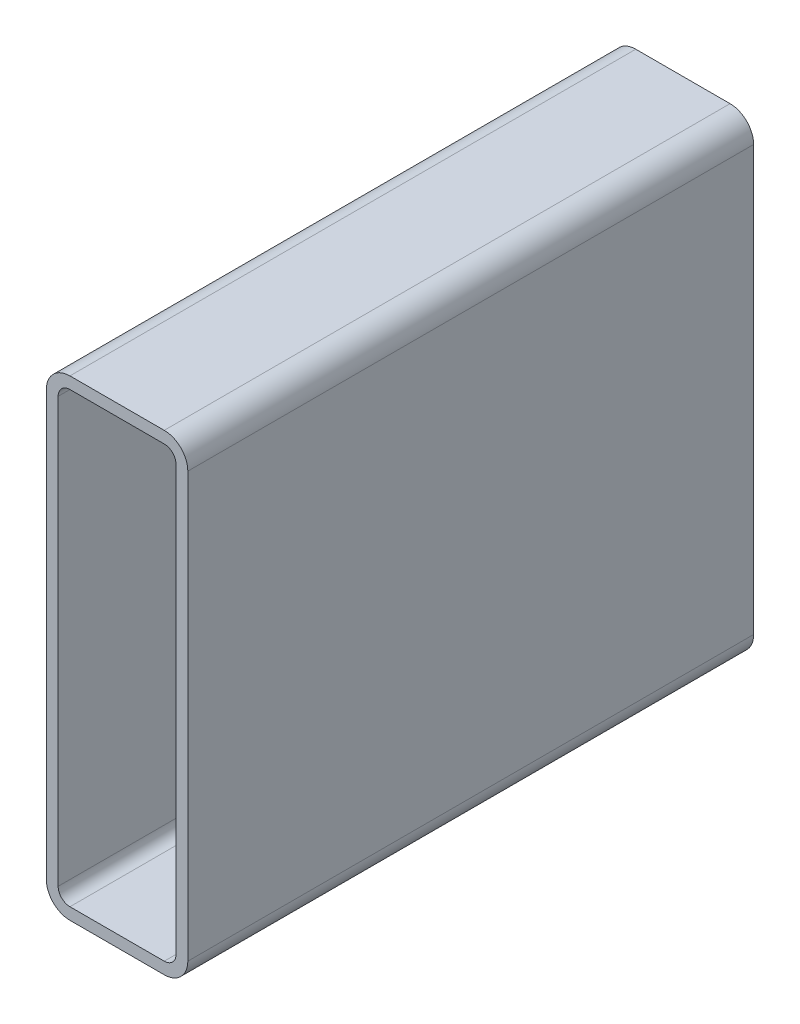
ISO-10303-21;
HEADER;
FILE_DESCRIPTION(('STEP AP214'),'2;1');
FILE_NAME('part.step','',(''),(''),'','','');
FILE_SCHEMA(('AUTOMOTIVE_DESIGN { 1 0 10303 214 1 1 1 1 }'));
ENDSEC;
DATA;
#1=APPLICATION_CONTEXT('core data for automotive mechanical design processes');
#2=APPLICATION_PROTOCOL_DEFINITION('international standard','automotive_design',2000,#1);
#3=PRODUCT_CONTEXT('',#1,'mechanical');
#4=PRODUCT('Part','Part','',(#3));
#5=PRODUCT_RELATED_PRODUCT_CATEGORY('part','',(#4));
#6=PRODUCT_DEFINITION_FORMATION('','',#4);
#7=PRODUCT_DEFINITION_CONTEXT('part definition',#1,'design');
#8=PRODUCT_DEFINITION('design','',#6,#7);
#9=PRODUCT_DEFINITION_SHAPE('','',#8);
#10=(LENGTH_UNIT() NAMED_UNIT(*) SI_UNIT(.MILLI.,.METRE.));
#11=(NAMED_UNIT(*) PLANE_ANGLE_UNIT() SI_UNIT($,.RADIAN.));
#12=(NAMED_UNIT(*) SI_UNIT($,.STERADIAN.) SOLID_ANGLE_UNIT());
#13=UNCERTAINTY_MEASURE_WITH_UNIT(LENGTH_MEASURE(1.E-05),#10,'distance_accuracy_value','');
#14=(GEOMETRIC_REPRESENTATION_CONTEXT(3) GLOBAL_UNCERTAINTY_ASSIGNED_CONTEXT((#13)) GLOBAL_UNIT_ASSIGNED_CONTEXT((#10,
#11,#12)) REPRESENTATION_CONTEXT('',''));
#15=CARTESIAN_POINT('',(0.,0.,0.));
#16=DIRECTION('',(0.,0.,1.));
#17=DIRECTION('',(1.,0.,0.));
#18=AXIS2_PLACEMENT_3D('',#15,#16,#17);
#19=CARTESIAN_POINT('',(15.1891160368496,243.220313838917,304.8));
#20=DIRECTION('',(0.,0.,1.));
#21=DIRECTION('',(1.,0.,0.));
#22=AXIS2_PLACEMENT_3D('',#19,#20,#21);
#23=PLANE('',#22);
#24=CARTESIAN_POINT('',(15.1891160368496,243.220313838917,304.8));
#25=DIRECTION('',(0.,0.,1.));
#26=DIRECTION('',(1.,0.,0.));
#27=AXIS2_PLACEMENT_3D('',#24,#25,#26);
#28=CIRCLE('',#27,12.7);
#29=CARTESIAN_POINT('',(15.1891160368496,255.920313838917,304.8));
#30=VERTEX_POINT('',#29);
#31=CARTESIAN_POINT('',(2.48911603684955,243.220313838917,304.8));
#32=VERTEX_POINT('',#31);
#33=EDGE_CURVE('E211',#30,#32,#28,.T.);
#34=ORIENTED_EDGE('',*,*,#33,.T.);
#35=DIRECTION('',(0.,-1.,0.));
#36=VECTOR('',#35,1.);
#37=CARTESIAN_POINT('',(2.48911603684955,14.6203138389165,304.8));
#38=LINE('',#37,#36);
#39=CARTESIAN_POINT('',(2.48911603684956,14.6203138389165,304.8));
#40=VERTEX_POINT('',#39);
#41=EDGE_CURVE('E214',#32,#40,#38,.T.);
#42=ORIENTED_EDGE('',*,*,#41,.T.);
#43=CARTESIAN_POINT('',(15.1891160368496,14.6203138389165,304.8));
#44=DIRECTION('',(0.,0.,1.));
#45=DIRECTION('',(1.,0.,0.));
#46=AXIS2_PLACEMENT_3D('',#43,#44,#45);
#47=CIRCLE('',#46,12.7);
#48=CARTESIAN_POINT('',(15.1891160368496,1.92031383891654,304.8));
#49=VERTEX_POINT('',#48);
#50=EDGE_CURVE('E217',#40,#49,#47,.T.);
#51=ORIENTED_EDGE('',*,*,#50,.T.);
#52=DIRECTION('',(1.,0.,0.));
#53=VECTOR('',#52,1.);
#54=CARTESIAN_POINT('',(65.9891160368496,1.92031383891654,304.8));
#55=LINE('',#54,#53);
#56=CARTESIAN_POINT('',(65.9891160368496,1.92031383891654,304.8));
#57=VERTEX_POINT('',#56);
#58=EDGE_CURVE('E219',#49,#57,#55,.T.);
#59=ORIENTED_EDGE('',*,*,#58,.T.);
#60=CARTESIAN_POINT('',(65.9891160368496,14.6203138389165,304.8));
#61=DIRECTION('',(0.,0.,1.));
#62=DIRECTION('',(1.,0.,0.));
#63=AXIS2_PLACEMENT_3D('',#60,#61,#62);
#64=CIRCLE('',#63,12.7);
#65=CARTESIAN_POINT('',(78.6891160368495,14.6203138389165,304.8));
#66=VERTEX_POINT('',#65);
#67=EDGE_CURVE('E221',#57,#66,#64,.T.);
#68=ORIENTED_EDGE('',*,*,#67,.T.);
#69=DIRECTION('',(0.,1.,0.));
#70=VECTOR('',#69,1.);
#71=CARTESIAN_POINT('',(78.6891160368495,243.220313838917,304.8));
#72=LINE('',#71,#70);
#73=CARTESIAN_POINT('',(78.6891160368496,243.220313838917,304.8));
#74=VERTEX_POINT('',#73);
#75=EDGE_CURVE('E223',#66,#74,#72,.T.);
#76=ORIENTED_EDGE('',*,*,#75,.T.);
#77=CARTESIAN_POINT('',(65.9891160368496,243.220313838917,304.8));
#78=DIRECTION('',(0.,0.,1.));
#79=DIRECTION('',(1.,0.,0.));
#80=AXIS2_PLACEMENT_3D('',#77,#78,#79);
#81=CIRCLE('',#80,12.7);
#82=CARTESIAN_POINT('',(65.9891160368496,255.920313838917,304.8));
#83=VERTEX_POINT('',#82);
#84=EDGE_CURVE('E225',#74,#83,#81,.T.);
#85=ORIENTED_EDGE('',*,*,#84,.T.);
#86=DIRECTION('',(-1.,0.,0.));
#87=VECTOR('',#86,1.);
#88=CARTESIAN_POINT('',(15.1891160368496,255.920313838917,304.8));
#89=LINE('',#88,#87);
#90=EDGE_CURVE('E227',#83,#30,#89,.T.);
#91=ORIENTED_EDGE('',*,*,#90,.T.);
#92=EDGE_LOOP('',(#34,#42,#51,#59,#68,#76,#85,#91));
#93=FACE_BOUND('',#92,.T.);
#94=DIRECTION('',(0.,-1.,0.));
#95=VECTOR('',#94,1.);
#96=CARTESIAN_POINT('',(8.83911603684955,14.6203138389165,304.8));
#97=LINE('',#96,#95);
#98=CARTESIAN_POINT('',(8.83911603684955,243.220313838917,304.8));
#99=VERTEX_POINT('',#98);
#100=CARTESIAN_POINT('',(8.83911603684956,14.6203138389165,304.8));
#101=VERTEX_POINT('',#100);
#102=EDGE_CURVE('E154',#99,#101,#97,.T.);
#103=ORIENTED_EDGE('',*,*,#102,.F.);
#104=CARTESIAN_POINT('',(15.1891160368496,243.220313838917,304.8));
#105=DIRECTION('',(0.,0.,1.));
#106=DIRECTION('',(1.,0.,0.));
#107=AXIS2_PLACEMENT_3D('',#104,#105,#106);
#108=CIRCLE('',#107,6.35000000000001);
#109=CARTESIAN_POINT('',(15.1891160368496,249.570313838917,304.8));
#110=VERTEX_POINT('',#109);
#111=EDGE_CURVE('E146',#110,#99,#108,.T.);
#112=ORIENTED_EDGE('',*,*,#111,.F.);
#113=DIRECTION('',(-1.,0.,0.));
#114=VECTOR('',#113,1.);
#115=CARTESIAN_POINT('',(15.1891160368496,249.570313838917,304.8));
#116=LINE('',#115,#114);
#117=CARTESIAN_POINT('',(65.9891160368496,249.570313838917,304.8));
#118=VERTEX_POINT('',#117);
#119=EDGE_CURVE('E179',#118,#110,#116,.T.);
#120=ORIENTED_EDGE('',*,*,#119,.F.);
#121=CARTESIAN_POINT('',(65.9891160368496,243.220313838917,304.8));
#122=DIRECTION('',(0.,0.,1.));
#123=DIRECTION('',(1.,0.,0.));
#124=AXIS2_PLACEMENT_3D('',#121,#122,#123);
#125=CIRCLE('',#124,6.35000000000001);
#126=CARTESIAN_POINT('',(72.3391160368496,243.220313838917,304.8));
#127=VERTEX_POINT('',#126);
#128=EDGE_CURVE('E177',#127,#118,#125,.T.);
#129=ORIENTED_EDGE('',*,*,#128,.F.);
#130=DIRECTION('',(0.,1.,0.));
#131=VECTOR('',#130,1.);
#132=CARTESIAN_POINT('',(72.3391160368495,243.220313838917,304.8));
#133=LINE('',#132,#131);
#134=CARTESIAN_POINT('',(72.3391160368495,14.6203138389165,304.8));
#135=VERTEX_POINT('',#134);
#136=EDGE_CURVE('E175',#135,#127,#133,.T.);
#137=ORIENTED_EDGE('',*,*,#136,.F.);
#138=CARTESIAN_POINT('',(65.9891160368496,14.6203138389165,304.8));
#139=DIRECTION('',(0.,0.,1.));
#140=DIRECTION('',(1.,0.,0.));
#141=AXIS2_PLACEMENT_3D('',#138,#139,#140);
#142=CIRCLE('',#141,6.35);
#143=CARTESIAN_POINT('',(65.9891160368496,8.27031383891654,304.8));
#144=VERTEX_POINT('',#143);
#145=EDGE_CURVE('E173',#144,#135,#142,.T.);
#146=ORIENTED_EDGE('',*,*,#145,.F.);
#147=DIRECTION('',(1.,0.,0.));
#148=VECTOR('',#147,1.);
#149=CARTESIAN_POINT('',(65.9891160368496,8.27031383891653,304.8));
#150=LINE('',#149,#148);
#151=CARTESIAN_POINT('',(15.1891160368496,8.27031383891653,304.8));
#152=VERTEX_POINT('',#151);
#153=EDGE_CURVE('E169',#152,#144,#150,.T.);
#154=ORIENTED_EDGE('',*,*,#153,.F.);
#155=CARTESIAN_POINT('',(15.1891160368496,14.6203138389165,304.8));
#156=DIRECTION('',(0.,0.,1.));
#157=DIRECTION('',(1.,0.,0.));
#158=AXIS2_PLACEMENT_3D('',#155,#156,#157);
#159=CIRCLE('',#158,6.35);
#160=EDGE_CURVE('E167',#101,#152,#159,.T.);
#161=ORIENTED_EDGE('',*,*,#160,.F.);
#162=EDGE_LOOP('',(#103,#112,#120,#129,#137,#146,#154,#161));
#163=FACE_BOUND('',#162,.T.);
#164=ADVANCED_FACE('F33',(#93,#163),#23,.T.);
#165=CARTESIAN_POINT('',(15.1891160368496,243.220313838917,0.));
#166=DIRECTION('',(0.,0.,1.));
#167=DIRECTION('',(1.,0.,0.));
#168=AXIS2_PLACEMENT_3D('',#165,#166,#167);
#169=PLANE('',#168);
#170=CARTESIAN_POINT('',(15.1891160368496,243.220313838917,0.));
#171=DIRECTION('',(0.,0.,1.));
#172=DIRECTION('',(1.,0.,0.));
#173=AXIS2_PLACEMENT_3D('',#170,#171,#172);
#174=CIRCLE('',#173,12.7);
#175=CARTESIAN_POINT('',(15.1891160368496,255.920313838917,0.));
#176=VERTEX_POINT('',#175);
#177=CARTESIAN_POINT('',(2.48911603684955,243.220313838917,0.));
#178=VERTEX_POINT('',#177);
#179=EDGE_CURVE('E162',#176,#178,#174,.T.);
#180=ORIENTED_EDGE('',*,*,#179,.F.);
#181=DIRECTION('',(-1.,0.,0.));
#182=VECTOR('',#181,1.);
#183=CARTESIAN_POINT('',(15.1891160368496,255.920313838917,0.));
#184=LINE('',#183,#182);
#185=CARTESIAN_POINT('',(65.9891160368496,255.920313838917,0.));
#186=VERTEX_POINT('',#185);
#187=EDGE_CURVE('E215',#186,#176,#184,.T.);
#188=ORIENTED_EDGE('',*,*,#187,.F.);
#189=CARTESIAN_POINT('',(65.9891160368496,243.220313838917,0.));
#190=DIRECTION('',(0.,0.,1.));
#191=DIRECTION('',(1.,0.,0.));
#192=AXIS2_PLACEMENT_3D('',#189,#190,#191);
#193=CIRCLE('',#192,12.7);
#194=CARTESIAN_POINT('',(78.6891160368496,243.220313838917,0.));
#195=VERTEX_POINT('',#194);
#196=EDGE_CURVE('E242',#195,#186,#193,.T.);
#197=ORIENTED_EDGE('',*,*,#196,.F.);
#198=DIRECTION('',(0.,1.,0.));
#199=VECTOR('',#198,1.);
#200=CARTESIAN_POINT('',(78.6891160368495,243.220313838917,0.));
#201=LINE('',#200,#199);
#202=CARTESIAN_POINT('',(78.6891160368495,14.6203138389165,0.));
#203=VERTEX_POINT('',#202);
#204=EDGE_CURVE('E240',#203,#195,#201,.T.);
#205=ORIENTED_EDGE('',*,*,#204,.F.);
#206=CARTESIAN_POINT('',(65.9891160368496,14.6203138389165,0.));
#207=DIRECTION('',(0.,0.,1.));
#208=DIRECTION('',(1.,0.,0.));
#209=AXIS2_PLACEMENT_3D('',#206,#207,#208);
#210=CIRCLE('',#209,12.7);
#211=CARTESIAN_POINT('',(65.9891160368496,1.92031383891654,0.));
#212=VERTEX_POINT('',#211);
#213=EDGE_CURVE('E238',#212,#203,#210,.T.);
#214=ORIENTED_EDGE('',*,*,#213,.F.);
#215=DIRECTION('',(1.,0.,0.));
#216=VECTOR('',#215,1.);
#217=CARTESIAN_POINT('',(65.9891160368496,1.92031383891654,0.));
#218=LINE('',#217,#216);
#219=CARTESIAN_POINT('',(15.1891160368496,1.92031383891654,0.));
#220=VERTEX_POINT('',#219);
#221=EDGE_CURVE('E236',#220,#212,#218,.T.);
#222=ORIENTED_EDGE('',*,*,#221,.F.);
#223=CARTESIAN_POINT('',(15.1891160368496,14.6203138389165,0.));
#224=DIRECTION('',(0.,0.,1.));
#225=DIRECTION('',(1.,0.,0.));
#226=AXIS2_PLACEMENT_3D('',#223,#224,#225);
#227=CIRCLE('',#226,12.7);
#228=CARTESIAN_POINT('',(2.48911603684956,14.6203138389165,0.));
#229=VERTEX_POINT('',#228);
#230=EDGE_CURVE('E234',#229,#220,#227,.T.);
#231=ORIENTED_EDGE('',*,*,#230,.F.);
#232=DIRECTION('',(0.,-1.,0.));
#233=VECTOR('',#232,1.);
#234=CARTESIAN_POINT('',(2.48911603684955,14.6203138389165,0.));
#235=LINE('',#234,#233);
#236=EDGE_CURVE('E232',#178,#229,#235,.T.);
#237=ORIENTED_EDGE('',*,*,#236,.F.);
#238=EDGE_LOOP('',(#180,#188,#197,#205,#214,#222,#231,#237));
#239=FACE_BOUND('',#238,.T.);
#240=CARTESIAN_POINT('',(15.1891160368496,243.220313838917,0.));
#241=DIRECTION('',(0.,0.,1.));
#242=DIRECTION('',(1.,0.,0.));
#243=AXIS2_PLACEMENT_3D('',#240,#241,#242);
#244=CIRCLE('',#243,6.35000000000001);
#245=CARTESIAN_POINT('',(15.1891160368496,249.570313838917,0.));
#246=VERTEX_POINT('',#245);
#247=CARTESIAN_POINT('',(8.83911603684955,243.220313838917,0.));
#248=VERTEX_POINT('',#247);
#249=EDGE_CURVE('E56',#246,#248,#244,.T.);
#250=ORIENTED_EDGE('',*,*,#249,.T.);
#251=DIRECTION('',(0.,-1.,0.));
#252=VECTOR('',#251,1.);
#253=CARTESIAN_POINT('',(8.83911603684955,14.6203138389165,0.));
#254=LINE('',#253,#252);
#255=CARTESIAN_POINT('',(8.83911603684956,14.6203138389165,0.));
#256=VERTEX_POINT('',#255);
#257=EDGE_CURVE('E161',#248,#256,#254,.T.);
#258=ORIENTED_EDGE('',*,*,#257,.T.);
#259=CARTESIAN_POINT('',(15.1891160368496,14.6203138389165,0.));
#260=DIRECTION('',(0.,0.,1.));
#261=DIRECTION('',(1.,0.,0.));
#262=AXIS2_PLACEMENT_3D('',#259,#260,#261);
#263=CIRCLE('',#262,6.35);
#264=CARTESIAN_POINT('',(15.1891160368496,8.27031383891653,0.));
#265=VERTEX_POINT('',#264);
#266=EDGE_CURVE('E183',#256,#265,#263,.T.);
#267=ORIENTED_EDGE('',*,*,#266,.T.);
#268=DIRECTION('',(1.,0.,0.));
#269=VECTOR('',#268,1.);
#270=CARTESIAN_POINT('',(65.9891160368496,8.27031383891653,0.));
#271=LINE('',#270,#269);
#272=CARTESIAN_POINT('',(65.9891160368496,8.27031383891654,0.));
#273=VERTEX_POINT('',#272);
#274=EDGE_CURVE('E186',#265,#273,#271,.T.);
#275=ORIENTED_EDGE('',*,*,#274,.T.);
#276=CARTESIAN_POINT('',(65.9891160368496,14.6203138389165,0.));
#277=DIRECTION('',(0.,0.,1.));
#278=DIRECTION('',(1.,0.,0.));
#279=AXIS2_PLACEMENT_3D('',#276,#277,#278);
#280=CIRCLE('',#279,6.35);
#281=CARTESIAN_POINT('',(72.3391160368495,14.6203138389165,0.));
#282=VERTEX_POINT('',#281);
#283=EDGE_CURVE('E189',#273,#282,#280,.T.);
#284=ORIENTED_EDGE('',*,*,#283,.T.);
#285=DIRECTION('',(0.,1.,0.));
#286=VECTOR('',#285,1.);
#287=CARTESIAN_POINT('',(72.3391160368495,243.220313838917,0.));
#288=LINE('',#287,#286);
#289=CARTESIAN_POINT('',(72.3391160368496,243.220313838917,0.));
#290=VERTEX_POINT('',#289);
#291=EDGE_CURVE('E192',#282,#290,#288,.T.);
#292=ORIENTED_EDGE('',*,*,#291,.T.);
#293=CARTESIAN_POINT('',(65.9891160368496,243.220313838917,0.));
#294=DIRECTION('',(0.,0.,1.));
#295=DIRECTION('',(1.,0.,0.));
#296=AXIS2_PLACEMENT_3D('',#293,#294,#295);
#297=CIRCLE('',#296,6.35000000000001);
#298=CARTESIAN_POINT('',(65.9891160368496,249.570313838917,0.));
#299=VERTEX_POINT('',#298);
#300=EDGE_CURVE('E195',#290,#299,#297,.T.);
#301=ORIENTED_EDGE('',*,*,#300,.T.);
#302=DIRECTION('',(-1.,0.,0.));
#303=VECTOR('',#302,1.);
#304=CARTESIAN_POINT('',(15.1891160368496,249.570313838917,0.));
#305=LINE('',#304,#303);
#306=EDGE_CURVE('E155',#299,#246,#305,.T.);
#307=ORIENTED_EDGE('',*,*,#306,.T.);
#308=EDGE_LOOP('',(#250,#258,#267,#275,#284,#292,#301,#307));
#309=FACE_BOUND('',#308,.T.);
#310=ADVANCED_FACE('F272',(#239,#309),#169,.F.);
#311=CARTESIAN_POINT('',(15.1891160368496,243.220313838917,304.8));
#312=DIRECTION('',(0.,0.,-1.));
#313=DIRECTION('',(-1.,0.,0.));
#314=AXIS2_PLACEMENT_3D('',#311,#312,#313);
#315=CYLINDRICAL_SURFACE('',#314,12.7);
#316=ORIENTED_EDGE('',*,*,#179,.T.);
#317=DIRECTION('',(0.,0.,-1.));
#318=VECTOR('',#317,1.);
#319=CARTESIAN_POINT('',(2.48911603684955,243.220313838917,304.8));
#320=LINE('',#319,#318);
#321=EDGE_CURVE('E11',#32,#178,#320,.T.);
#322=ORIENTED_EDGE('',*,*,#321,.F.);
#323=ORIENTED_EDGE('',*,*,#33,.F.);
#324=DIRECTION('',(0.,0.,-1.));
#325=VECTOR('',#324,1.);
#326=CARTESIAN_POINT('',(15.1891160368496,255.920313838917,304.8));
#327=LINE('',#326,#325);
#328=EDGE_CURVE('E229',#30,#176,#327,.T.);
#329=ORIENTED_EDGE('',*,*,#328,.T.);
#330=EDGE_LOOP('',(#316,#322,#323,#329));
#331=FACE_BOUND('',#330,.T.);
#332=ADVANCED_FACE('F35',(#331),#315,.T.);
#333=CARTESIAN_POINT('',(2.48911603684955,14.6203138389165,304.8));
#334=DIRECTION('',(1.,0.,0.));
#335=DIRECTION('',(0.,0.,-1.));
#336=AXIS2_PLACEMENT_3D('',#333,#334,#335);
#337=PLANE('',#336);
#338=ORIENTED_EDGE('',*,*,#236,.T.);
#339=DIRECTION('',(0.,0.,-1.));
#340=VECTOR('',#339,1.);
#341=CARTESIAN_POINT('',(2.48911603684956,14.6203138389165,304.8));
#342=LINE('',#341,#340);
#343=EDGE_CURVE('E41',#40,#229,#342,.T.);
#344=ORIENTED_EDGE('',*,*,#343,.F.);
#345=ORIENTED_EDGE('',*,*,#41,.F.);
#346=ORIENTED_EDGE('',*,*,#321,.T.);
#347=EDGE_LOOP('',(#338,#344,#345,#346));
#348=FACE_BOUND('',#347,.T.);
#349=ADVANCED_FACE('F289',(#348),#337,.F.);
#350=CARTESIAN_POINT('',(15.1891160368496,14.6203138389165,304.8));
#351=DIRECTION('',(0.,0.,-1.));
#352=DIRECTION('',(-1.,0.,0.));
#353=AXIS2_PLACEMENT_3D('',#350,#351,#352);
#354=CYLINDRICAL_SURFACE('',#353,12.7);
#355=ORIENTED_EDGE('',*,*,#230,.T.);
#356=DIRECTION('',(0.,0.,-1.));
#357=VECTOR('',#356,1.);
#358=CARTESIAN_POINT('',(15.1891160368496,1.92031383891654,304.8));
#359=LINE('',#358,#357);
#360=EDGE_CURVE('E259',#49,#220,#359,.T.);
#361=ORIENTED_EDGE('',*,*,#360,.F.);
#362=ORIENTED_EDGE('',*,*,#50,.F.);
#363=ORIENTED_EDGE('',*,*,#343,.T.);
#364=EDGE_LOOP('',(#355,#361,#362,#363));
#365=FACE_BOUND('',#364,.T.);
#366=ADVANCED_FACE('F266',(#365),#354,.T.);
#367=CARTESIAN_POINT('',(65.9891160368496,1.92031383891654,304.8));
#368=DIRECTION('',(0.,1.,0.));
#369=DIRECTION('',(0.,0.,1.));
#370=AXIS2_PLACEMENT_3D('',#367,#368,#369);
#371=PLANE('',#370);
#372=ORIENTED_EDGE('',*,*,#221,.T.);
#373=DIRECTION('',(0.,0.,-1.));
#374=VECTOR('',#373,1.);
#375=CARTESIAN_POINT('',(65.9891160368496,1.92031383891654,304.8));
#376=LINE('',#375,#374);
#377=EDGE_CURVE('E256',#57,#212,#376,.T.);
#378=ORIENTED_EDGE('',*,*,#377,.F.);
#379=ORIENTED_EDGE('',*,*,#58,.F.);
#380=ORIENTED_EDGE('',*,*,#360,.T.);
#381=EDGE_LOOP('',(#372,#378,#379,#380));
#382=FACE_BOUND('',#381,.T.);
#383=ADVANCED_FACE('F278',(#382),#371,.F.);
#384=CARTESIAN_POINT('',(65.9891160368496,14.6203138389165,304.8));
#385=DIRECTION('',(0.,0.,-1.));
#386=DIRECTION('',(-1.,0.,0.));
#387=AXIS2_PLACEMENT_3D('',#384,#385,#386);
#388=CYLINDRICAL_SURFACE('',#387,12.7);
#389=ORIENTED_EDGE('',*,*,#213,.T.);
#390=DIRECTION('',(0.,0.,-1.));
#391=VECTOR('',#390,1.);
#392=CARTESIAN_POINT('',(78.6891160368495,14.6203138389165,304.8));
#393=LINE('',#392,#391);
#394=EDGE_CURVE('E253',#66,#203,#393,.T.);
#395=ORIENTED_EDGE('',*,*,#394,.F.);
#396=ORIENTED_EDGE('',*,*,#67,.F.);
#397=ORIENTED_EDGE('',*,*,#377,.T.);
#398=EDGE_LOOP('',(#389,#395,#396,#397));
#399=FACE_BOUND('',#398,.T.);
#400=ADVANCED_FACE('F282',(#399),#388,.T.);
#401=CARTESIAN_POINT('',(78.6891160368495,243.220313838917,304.8));
#402=DIRECTION('',(-1.,0.,0.));
#403=DIRECTION('',(0.,0.,1.));
#404=AXIS2_PLACEMENT_3D('',#401,#402,#403);
#405=PLANE('',#404);
#406=ORIENTED_EDGE('',*,*,#204,.T.);
#407=DIRECTION('',(0.,0.,-1.));
#408=VECTOR('',#407,1.);
#409=CARTESIAN_POINT('',(78.6891160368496,243.220313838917,304.8));
#410=LINE('',#409,#408);
#411=EDGE_CURVE('E250',#74,#195,#410,.T.);
#412=ORIENTED_EDGE('',*,*,#411,.F.);
#413=ORIENTED_EDGE('',*,*,#75,.F.);
#414=ORIENTED_EDGE('',*,*,#394,.T.);
#415=EDGE_LOOP('',(#406,#412,#413,#414));
#416=FACE_BOUND('',#415,.T.);
#417=ADVANCED_FACE('F302',(#416),#405,.F.);
#418=CARTESIAN_POINT('',(65.9891160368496,243.220313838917,304.8));
#419=DIRECTION('',(0.,0.,-1.));
#420=DIRECTION('',(-1.,0.,0.));
#421=AXIS2_PLACEMENT_3D('',#418,#419,#420);
#422=CYLINDRICAL_SURFACE('',#421,12.7);
#423=ORIENTED_EDGE('',*,*,#196,.T.);
#424=DIRECTION('',(0.,0.,-1.));
#425=VECTOR('',#424,1.);
#426=CARTESIAN_POINT('',(65.9891160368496,255.920313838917,304.8));
#427=LINE('',#426,#425);
#428=EDGE_CURVE('E247',#83,#186,#427,.T.);
#429=ORIENTED_EDGE('',*,*,#428,.F.);
#430=ORIENTED_EDGE('',*,*,#84,.F.);
#431=ORIENTED_EDGE('',*,*,#411,.T.);
#432=EDGE_LOOP('',(#423,#429,#430,#431));
#433=FACE_BOUND('',#432,.T.);
#434=ADVANCED_FACE('F300',(#433),#422,.T.);
#435=CARTESIAN_POINT('',(15.1891160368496,255.920313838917,304.8));
#436=DIRECTION('',(0.,-1.,0.));
#437=DIRECTION('',(0.,0.,-1.));
#438=AXIS2_PLACEMENT_3D('',#435,#436,#437);
#439=PLANE('',#438);
#440=ORIENTED_EDGE('',*,*,#187,.T.);
#441=ORIENTED_EDGE('',*,*,#328,.F.);
#442=ORIENTED_EDGE('',*,*,#90,.F.);
#443=ORIENTED_EDGE('',*,*,#428,.T.);
#444=EDGE_LOOP('',(#440,#441,#442,#443));
#445=FACE_BOUND('',#444,.T.);
#446=ADVANCED_FACE('F295',(#445),#439,.F.);
#447=CARTESIAN_POINT('',(15.1891160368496,243.220313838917,304.8));
#448=DIRECTION('',(0.,0.,-1.));
#449=DIRECTION('',(-1.,0.,0.));
#450=AXIS2_PLACEMENT_3D('',#447,#448,#449);
#451=CYLINDRICAL_SURFACE('',#450,6.35000000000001);
#452=ORIENTED_EDGE('',*,*,#249,.F.);
#453=DIRECTION('',(0.,0.,-1.));
#454=VECTOR('',#453,1.);
#455=CARTESIAN_POINT('',(15.1891160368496,249.570313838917,304.8));
#456=LINE('',#455,#454);
#457=EDGE_CURVE('E150',#110,#246,#456,.T.);
#458=ORIENTED_EDGE('',*,*,#457,.F.);
#459=ORIENTED_EDGE('',*,*,#111,.T.);
#460=DIRECTION('',(0.,0.,-1.));
#461=VECTOR('',#460,1.);
#462=CARTESIAN_POINT('',(8.83911603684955,243.220313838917,304.8));
#463=LINE('',#462,#461);
#464=EDGE_CURVE('E149',#99,#248,#463,.T.);
#465=ORIENTED_EDGE('',*,*,#464,.T.);
#466=EDGE_LOOP('',(#452,#458,#459,#465));
#467=FACE_BOUND('',#466,.T.);
#468=ADVANCED_FACE('F148',(#467),#451,.F.);
#469=CARTESIAN_POINT('',(8.83911603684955,14.6203138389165,304.8));
#470=DIRECTION('',(1.,0.,0.));
#471=DIRECTION('',(0.,0.,-1.));
#472=AXIS2_PLACEMENT_3D('',#469,#470,#471);
#473=PLANE('',#472);
#474=ORIENTED_EDGE('',*,*,#257,.F.);
#475=ORIENTED_EDGE('',*,*,#464,.F.);
#476=ORIENTED_EDGE('',*,*,#102,.T.);
#477=DIRECTION('',(0.,0.,-1.));
#478=VECTOR('',#477,1.);
#479=CARTESIAN_POINT('',(8.83911603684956,14.6203138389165,304.8));
#480=LINE('',#479,#478);
#481=EDGE_CURVE('E163',#101,#256,#480,.T.);
#482=ORIENTED_EDGE('',*,*,#481,.T.);
#483=EDGE_LOOP('',(#474,#475,#476,#482));
#484=FACE_BOUND('',#483,.T.);
#485=ADVANCED_FACE('F158',(#484),#473,.T.);
#486=CARTESIAN_POINT('',(15.1891160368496,14.6203138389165,304.8));
#487=DIRECTION('',(0.,0.,-1.));
#488=DIRECTION('',(-1.,0.,0.));
#489=AXIS2_PLACEMENT_3D('',#486,#487,#488);
#490=CYLINDRICAL_SURFACE('',#489,6.35);
#491=ORIENTED_EDGE('',*,*,#266,.F.);
#492=ORIENTED_EDGE('',*,*,#481,.F.);
#493=ORIENTED_EDGE('',*,*,#160,.T.);
#494=DIRECTION('',(0.,0.,-1.));
#495=VECTOR('',#494,1.);
#496=CARTESIAN_POINT('',(15.1891160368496,8.27031383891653,304.8));
#497=LINE('',#496,#495);
#498=EDGE_CURVE('E208',#152,#265,#497,.T.);
#499=ORIENTED_EDGE('',*,*,#498,.T.);
#500=EDGE_LOOP('',(#491,#492,#493,#499));
#501=FACE_BOUND('',#500,.T.);
#502=ADVANCED_FACE('F327',(#501),#490,.F.);
#503=CARTESIAN_POINT('',(65.9891160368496,8.27031383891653,304.8));
#504=DIRECTION('',(0.,1.,0.));
#505=DIRECTION('',(0.,0.,1.));
#506=AXIS2_PLACEMENT_3D('',#503,#504,#505);
#507=PLANE('',#506);
#508=ORIENTED_EDGE('',*,*,#274,.F.);
#509=ORIENTED_EDGE('',*,*,#498,.F.);
#510=ORIENTED_EDGE('',*,*,#153,.T.);
#511=DIRECTION('',(0.,0.,-1.));
#512=VECTOR('',#511,1.);
#513=CARTESIAN_POINT('',(65.9891160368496,8.27031383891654,304.8));
#514=LINE('',#513,#512);
#515=EDGE_CURVE('E206',#144,#273,#514,.T.);
#516=ORIENTED_EDGE('',*,*,#515,.T.);
#517=EDGE_LOOP('',(#508,#509,#510,#516));
#518=FACE_BOUND('',#517,.T.);
#519=ADVANCED_FACE('F331',(#518),#507,.T.);
#520=CARTESIAN_POINT('',(65.9891160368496,14.6203138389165,304.8));
#521=DIRECTION('',(0.,0.,-1.));
#522=DIRECTION('',(-1.,0.,0.));
#523=AXIS2_PLACEMENT_3D('',#520,#521,#522);
#524=CYLINDRICAL_SURFACE('',#523,6.35);
#525=ORIENTED_EDGE('',*,*,#283,.F.);
#526=ORIENTED_EDGE('',*,*,#515,.F.);
#527=ORIENTED_EDGE('',*,*,#145,.T.);
#528=DIRECTION('',(0.,0.,-1.));
#529=VECTOR('',#528,1.);
#530=CARTESIAN_POINT('',(72.3391160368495,14.6203138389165,304.8));
#531=LINE('',#530,#529);
#532=EDGE_CURVE('E204',#135,#282,#531,.T.);
#533=ORIENTED_EDGE('',*,*,#532,.T.);
#534=EDGE_LOOP('',(#525,#526,#527,#533));
#535=FACE_BOUND('',#534,.T.);
#536=ADVANCED_FACE('F337',(#535),#524,.F.);
#537=CARTESIAN_POINT('',(72.3391160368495,243.220313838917,304.8));
#538=DIRECTION('',(-1.,0.,0.));
#539=DIRECTION('',(0.,0.,1.));
#540=AXIS2_PLACEMENT_3D('',#537,#538,#539);
#541=PLANE('',#540);
#542=ORIENTED_EDGE('',*,*,#291,.F.);
#543=ORIENTED_EDGE('',*,*,#532,.F.);
#544=ORIENTED_EDGE('',*,*,#136,.T.);
#545=DIRECTION('',(0.,0.,-1.));
#546=VECTOR('',#545,1.);
#547=CARTESIAN_POINT('',(72.3391160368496,243.220313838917,304.8));
#548=LINE('',#547,#546);
#549=EDGE_CURVE('E202',#127,#290,#548,.T.);
#550=ORIENTED_EDGE('',*,*,#549,.T.);
#551=EDGE_LOOP('',(#542,#543,#544,#550));
#552=FACE_BOUND('',#551,.T.);
#553=ADVANCED_FACE('F341',(#552),#541,.T.);
#554=CARTESIAN_POINT('',(65.9891160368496,243.220313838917,304.8));
#555=DIRECTION('',(0.,0.,-1.));
#556=DIRECTION('',(-1.,0.,0.));
#557=AXIS2_PLACEMENT_3D('',#554,#555,#556);
#558=CYLINDRICAL_SURFACE('',#557,6.35000000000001);
#559=ORIENTED_EDGE('',*,*,#300,.F.);
#560=ORIENTED_EDGE('',*,*,#549,.F.);
#561=ORIENTED_EDGE('',*,*,#128,.T.);
#562=DIRECTION('',(0.,0.,-1.));
#563=VECTOR('',#562,1.);
#564=CARTESIAN_POINT('',(65.9891160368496,249.570313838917,304.8));
#565=LINE('',#564,#563);
#566=EDGE_CURVE('E48',#118,#299,#565,.T.);
#567=ORIENTED_EDGE('',*,*,#566,.T.);
#568=EDGE_LOOP('',(#559,#560,#561,#567));
#569=FACE_BOUND('',#568,.T.);
#570=ADVANCED_FACE('F345',(#569),#558,.F.);
#571=CARTESIAN_POINT('',(15.1891160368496,249.570313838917,304.8));
#572=DIRECTION('',(0.,-1.,0.));
#573=DIRECTION('',(0.,0.,-1.));
#574=AXIS2_PLACEMENT_3D('',#571,#572,#573);
#575=PLANE('',#574);
#576=ORIENTED_EDGE('',*,*,#306,.F.);
#577=ORIENTED_EDGE('',*,*,#566,.F.);
#578=ORIENTED_EDGE('',*,*,#119,.T.);
#579=ORIENTED_EDGE('',*,*,#457,.T.);
#580=EDGE_LOOP('',(#576,#577,#578,#579));
#581=FACE_BOUND('',#580,.T.);
#582=ADVANCED_FACE('F349',(#581),#575,.T.);
#583=CLOSED_SHELL('',(#164,#310,#332,#349,#366,#383,#400,#417,#434,#446,#468,#485,#502,#519,
#536,#553,#570,#582));
#584=MANIFOLD_SOLID_BREP('B2',#583);
#585=ADVANCED_BREP_SHAPE_REPRESENTATION('',(#18,#584),#14);
#586=SHAPE_DEFINITION_REPRESENTATION(#9,#585);
ENDSEC;
END-ISO-10303-21;
